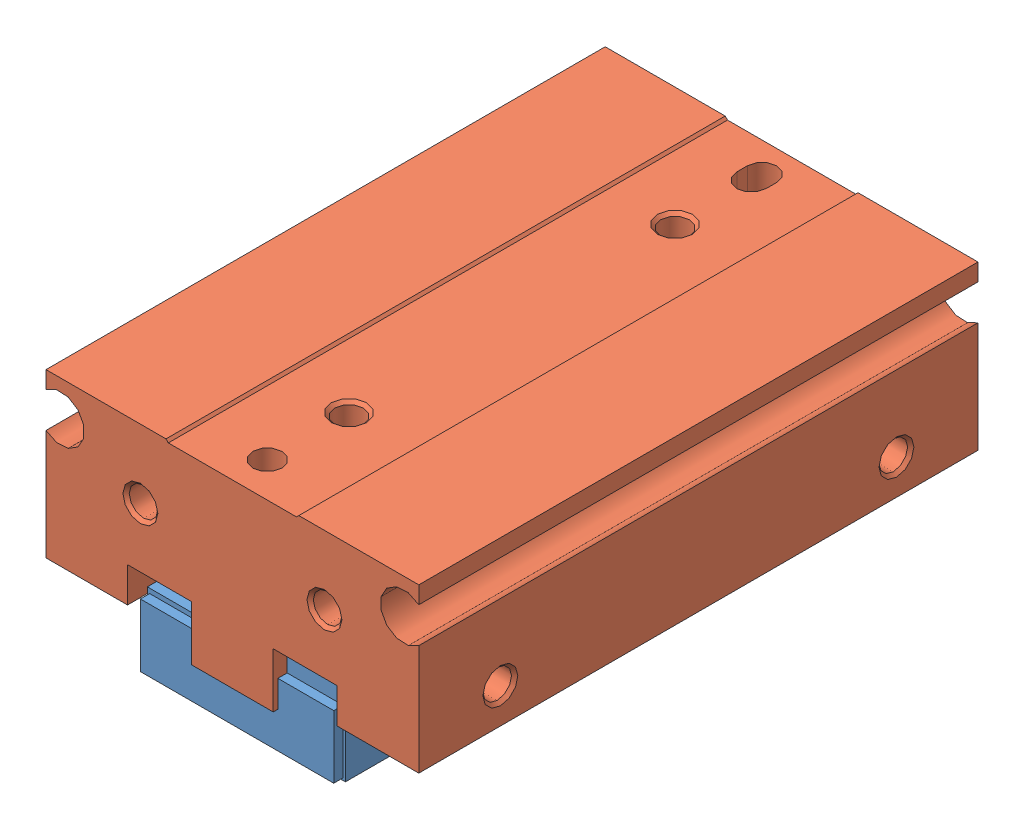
SolidWorks assembly SHF8-16D.sldasm, configuration Default (file format 11000). Lengths in mm.
Overall size (32 19 48).
3 component instances, 2 part files, 0 mates.
Components (placement in the parent):
- SHF8-1602-1: SHF8-1602.sldprt [Default] at (0 -19 -8) x (-1 0 0) z (0 0 -1) size (17 9.6 30.8)
- SHF8-1602-2: SHF8-1602.sldprt [Default] at (0 -19 8) size (17 9.6 30.8)
- SHF8-1601-1: SHF8-1601.sldprt [Default] at origin size (32 15.7 48)
